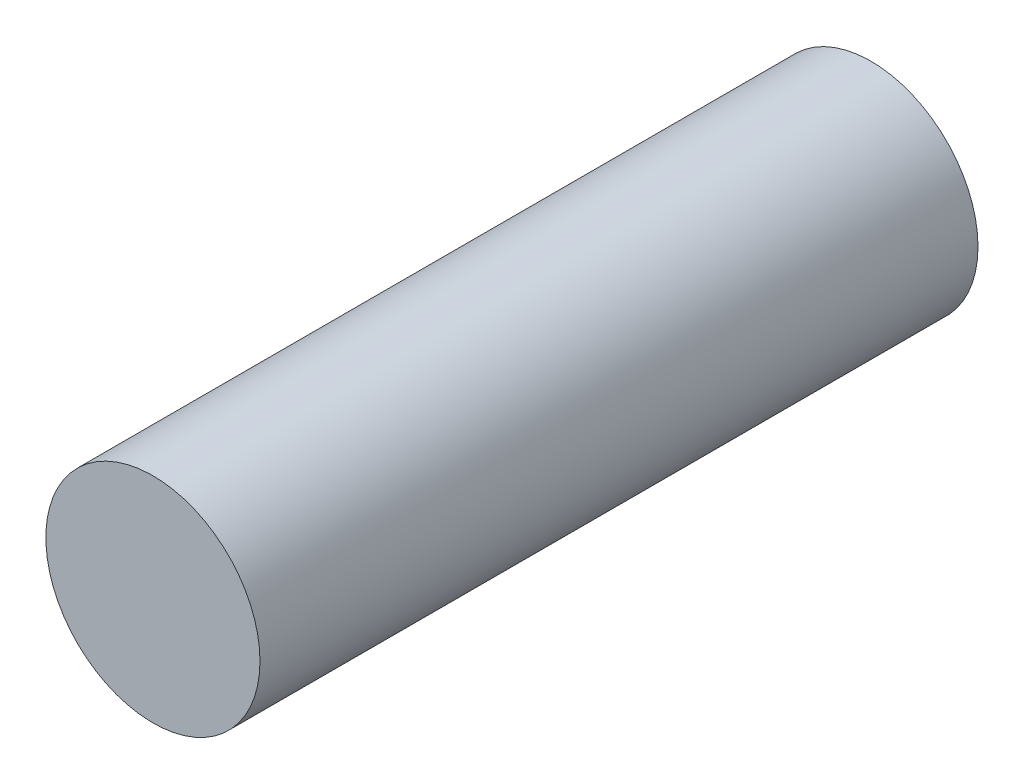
from build123d import *

# Parameters (mm, degrees)
SKETCH1_R           = 0.6477
BOSS_EXTRUDE1_DEPTH = 4.3434


with BuildPart() as part:
    # Sketch1 → Boss-Extrude1 (new body)
    with BuildSketch(Plane.XY):
        Circle(SKETCH1_R)
    extrude(amount=BOSS_EXTRUDE1_DEPTH)


solid = part.part
